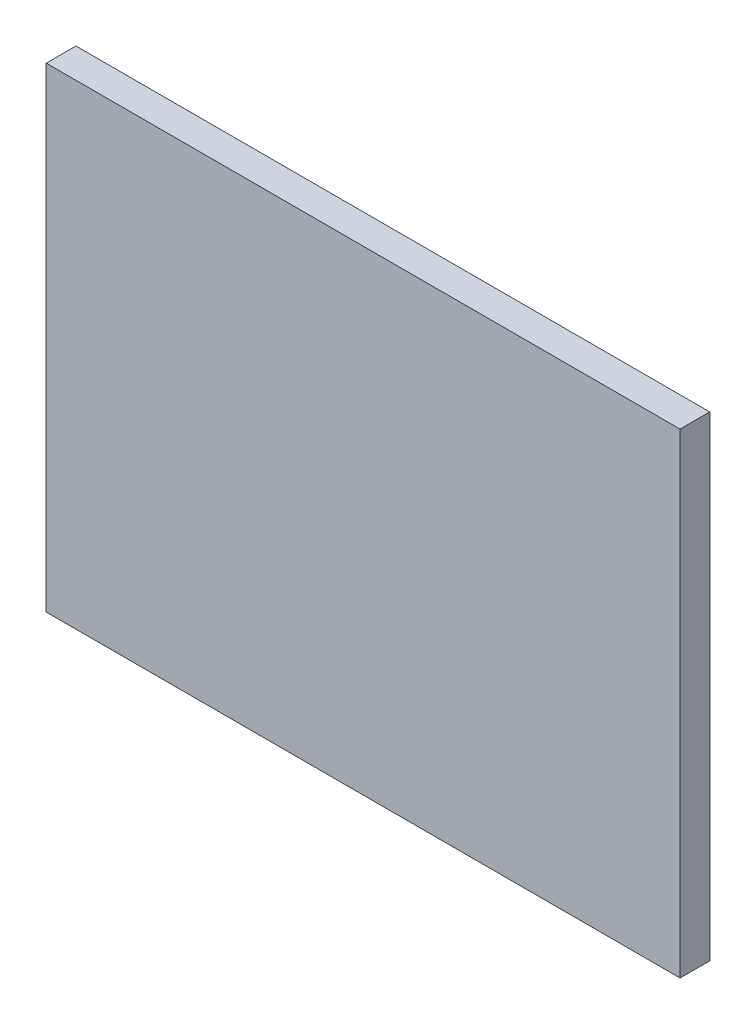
from build123d import *

# Parameters (mm, degrees)
SKETCH1_W          = 406.4
SKETCH1_H          = 304.8
BASE_EXTRUDE_DEPTH = 19.05


with BuildPart() as part:
    # Sketch1 → Base-Extrude (new body)
    with BuildSketch(Plane.XY):
        with Locations((102.799589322, -75.808829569)):
            Rectangle(SKETCH1_W, SKETCH1_H)
    extrude(amount=BASE_EXTRUDE_DEPTH)


solid = part.part
